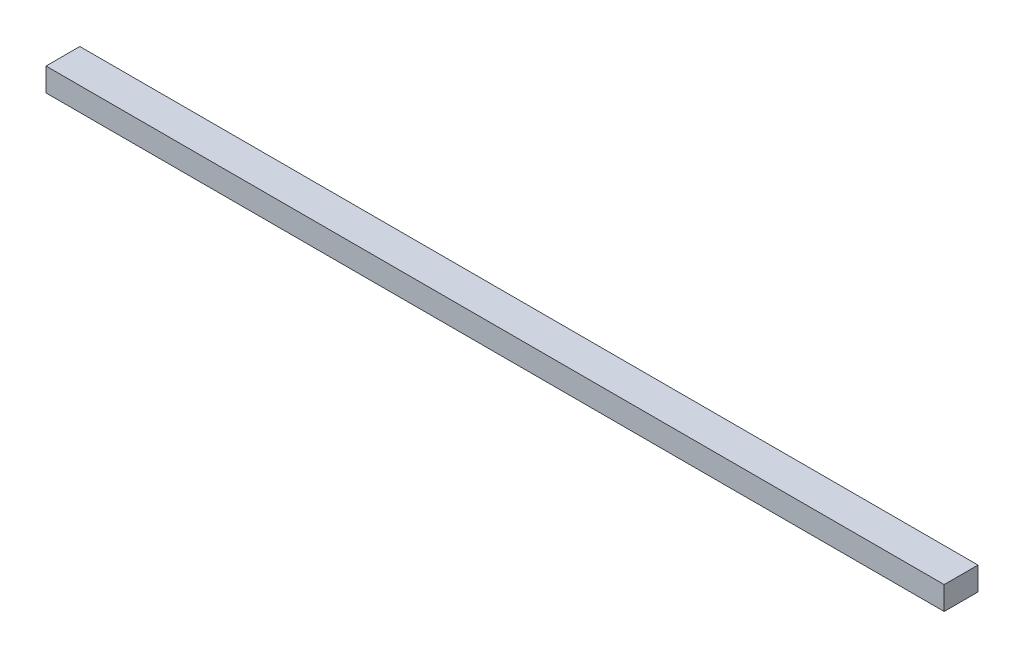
ISO-10303-21;
HEADER;
FILE_DESCRIPTION(('STEP AP214'),'2;1');
FILE_NAME('part.step','',(''),(''),'','','');
FILE_SCHEMA(('AUTOMOTIVE_DESIGN { 1 0 10303 214 1 1 1 1 }'));
ENDSEC;
DATA;
#1=APPLICATION_CONTEXT('core data for automotive mechanical design processes');
#2=APPLICATION_PROTOCOL_DEFINITION('international standard','automotive_design',2000,#1);
#3=PRODUCT_CONTEXT('',#1,'mechanical');
#4=PRODUCT('Part','Part','',(#3));
#5=PRODUCT_RELATED_PRODUCT_CATEGORY('part','',(#4));
#6=PRODUCT_DEFINITION_FORMATION('','',#4);
#7=PRODUCT_DEFINITION_CONTEXT('part definition',#1,'design');
#8=PRODUCT_DEFINITION('design','',#6,#7);
#9=PRODUCT_DEFINITION_SHAPE('','',#8);
#10=(LENGTH_UNIT() NAMED_UNIT(*) SI_UNIT(.MILLI.,.METRE.));
#11=(NAMED_UNIT(*) PLANE_ANGLE_UNIT() SI_UNIT($,.RADIAN.));
#12=(NAMED_UNIT(*) SI_UNIT($,.STERADIAN.) SOLID_ANGLE_UNIT());
#13=UNCERTAINTY_MEASURE_WITH_UNIT(LENGTH_MEASURE(1.E-05),#10,'distance_accuracy_value','');
#14=(GEOMETRIC_REPRESENTATION_CONTEXT(3) GLOBAL_UNCERTAINTY_ASSIGNED_CONTEXT((#13)) GLOBAL_UNIT_ASSIGNED_CONTEXT((#10,
#11,#12)) REPRESENTATION_CONTEXT('',''));
#15=CARTESIAN_POINT('',(0.,0.,0.));
#16=DIRECTION('',(0.,0.,1.));
#17=DIRECTION('',(1.,0.,0.));
#18=AXIS2_PLACEMENT_3D('',#15,#16,#17);
#19=CARTESIAN_POINT('',(244.475,12.7,9.2075));
#20=DIRECTION('',(-1.,0.,0.));
#21=DIRECTION('',(0.,0.,1.));
#22=AXIS2_PLACEMENT_3D('',#19,#20,#21);
#23=PLANE('',#22);
#24=DIRECTION('',(0.,0.,-1.));
#25=VECTOR('',#24,1.);
#26=CARTESIAN_POINT('',(244.475,0.,9.2075));
#27=LINE('',#26,#25);
#28=CARTESIAN_POINT('',(244.475,0.,9.2075));
#29=VERTEX_POINT('',#28);
#30=CARTESIAN_POINT('',(244.475,0.,-9.2075));
#31=VERTEX_POINT('',#30);
#32=EDGE_CURVE('E95',#29,#31,#27,.T.);
#33=ORIENTED_EDGE('',*,*,#32,.T.);
#34=DIRECTION('',(0.,-1.,0.));
#35=VECTOR('',#34,1.);
#36=CARTESIAN_POINT('',(244.475,12.7,-9.2075));
#37=LINE('',#36,#35);
#38=CARTESIAN_POINT('',(244.475,12.7,-9.2075));
#39=VERTEX_POINT('',#38);
#40=EDGE_CURVE('E11',#39,#31,#37,.T.);
#41=ORIENTED_EDGE('',*,*,#40,.F.);
#42=DIRECTION('',(0.,0.,-1.));
#43=VECTOR('',#42,1.);
#44=CARTESIAN_POINT('',(244.475,12.7,9.2075));
#45=LINE('',#44,#43);
#46=CARTESIAN_POINT('',(244.475,12.7,9.2075));
#47=VERTEX_POINT('',#46);
#48=EDGE_CURVE('E83',#47,#39,#45,.T.);
#49=ORIENTED_EDGE('',*,*,#48,.F.);
#50=DIRECTION('',(0.,-1.,0.));
#51=VECTOR('',#50,1.);
#52=CARTESIAN_POINT('',(244.475,12.7,9.2075));
#53=LINE('',#52,#51);
#54=EDGE_CURVE('E91',#47,#29,#53,.T.);
#55=ORIENTED_EDGE('',*,*,#54,.T.);
#56=EDGE_LOOP('',(#33,#41,#49,#55));
#57=FACE_BOUND('',#56,.T.);
#58=ADVANCED_FACE('F32',(#57),#23,.F.);
#59=CARTESIAN_POINT('',(-244.475,12.7,-9.2075));
#60=DIRECTION('',(0.,0.,1.));
#61=DIRECTION('',(1.,0.,0.));
#62=AXIS2_PLACEMENT_3D('',#59,#60,#61);
#63=PLANE('',#62);
#64=DIRECTION('',(-1.,0.,0.));
#65=VECTOR('',#64,1.);
#66=CARTESIAN_POINT('',(-244.475,0.,-9.2075));
#67=LINE('',#66,#65);
#68=CARTESIAN_POINT('',(-244.475,0.,-9.2075));
#69=VERTEX_POINT('',#68);
#70=EDGE_CURVE('E87',#31,#69,#67,.T.);
#71=ORIENTED_EDGE('',*,*,#70,.T.);
#72=DIRECTION('',(0.,-1.,0.));
#73=VECTOR('',#72,1.);
#74=CARTESIAN_POINT('',(-244.475,12.7,-9.2075));
#75=LINE('',#74,#73);
#76=CARTESIAN_POINT('',(-244.475,12.7,-9.2075));
#77=VERTEX_POINT('',#76);
#78=EDGE_CURVE('E40',#77,#69,#75,.T.);
#79=ORIENTED_EDGE('',*,*,#78,.F.);
#80=DIRECTION('',(-1.,0.,0.));
#81=VECTOR('',#80,1.);
#82=CARTESIAN_POINT('',(-244.475,12.7,-9.2075));
#83=LINE('',#82,#81);
#84=EDGE_CURVE('E78',#39,#77,#83,.T.);
#85=ORIENTED_EDGE('',*,*,#84,.F.);
#86=ORIENTED_EDGE('',*,*,#40,.T.);
#87=EDGE_LOOP('',(#71,#79,#85,#86));
#88=FACE_BOUND('',#87,.T.);
#89=ADVANCED_FACE('F86',(#88),#63,.F.);
#90=CARTESIAN_POINT('',(-244.475,12.7,9.2075));
#91=DIRECTION('',(1.,0.,0.));
#92=DIRECTION('',(0.,0.,-1.));
#93=AXIS2_PLACEMENT_3D('',#90,#91,#92);
#94=PLANE('',#93);
#95=DIRECTION('',(0.,0.,1.));
#96=VECTOR('',#95,1.);
#97=CARTESIAN_POINT('',(-244.475,0.,9.2075));
#98=LINE('',#97,#96);
#99=CARTESIAN_POINT('',(-244.475,0.,9.2075));
#100=VERTEX_POINT('',#99);
#101=EDGE_CURVE('E65',#69,#100,#98,.T.);
#102=ORIENTED_EDGE('',*,*,#101,.T.);
#103=DIRECTION('',(0.,-1.,0.));
#104=VECTOR('',#103,1.);
#105=CARTESIAN_POINT('',(-244.475,12.7,9.2075));
#106=LINE('',#105,#104);
#107=CARTESIAN_POINT('',(-244.475,12.7,9.2075));
#108=VERTEX_POINT('',#107);
#109=EDGE_CURVE('E88',#108,#100,#106,.T.);
#110=ORIENTED_EDGE('',*,*,#109,.F.);
#111=DIRECTION('',(0.,0.,1.));
#112=VECTOR('',#111,1.);
#113=CARTESIAN_POINT('',(-244.475,12.7,9.2075));
#114=LINE('',#113,#112);
#115=EDGE_CURVE('E81',#77,#108,#114,.T.);
#116=ORIENTED_EDGE('',*,*,#115,.F.);
#117=ORIENTED_EDGE('',*,*,#78,.T.);
#118=EDGE_LOOP('',(#102,#110,#116,#117));
#119=FACE_BOUND('',#118,.T.);
#120=ADVANCED_FACE('F89',(#119),#94,.F.);
#121=CARTESIAN_POINT('',(-244.475,12.7,9.2075));
#122=DIRECTION('',(0.,0.,-1.));
#123=DIRECTION('',(-1.,0.,0.));
#124=AXIS2_PLACEMENT_3D('',#121,#122,#123);
#125=PLANE('',#124);
#126=DIRECTION('',(1.,0.,0.));
#127=VECTOR('',#126,1.);
#128=CARTESIAN_POINT('',(-244.475,0.,9.2075));
#129=LINE('',#128,#127);
#130=EDGE_CURVE('E71',#100,#29,#129,.T.);
#131=ORIENTED_EDGE('',*,*,#130,.T.);
#132=ORIENTED_EDGE('',*,*,#54,.F.);
#133=DIRECTION('',(1.,0.,0.));
#134=VECTOR('',#133,1.);
#135=CARTESIAN_POINT('',(-244.475,12.7,9.2075));
#136=LINE('',#135,#134);
#137=EDGE_CURVE('E48',#108,#47,#136,.T.);
#138=ORIENTED_EDGE('',*,*,#137,.F.);
#139=ORIENTED_EDGE('',*,*,#109,.T.);
#140=EDGE_LOOP('',(#131,#132,#138,#139));
#141=FACE_BOUND('',#140,.T.);
#142=ADVANCED_FACE('F102',(#141),#125,.F.);
#143=CARTESIAN_POINT('',(0.,12.7,0.));
#144=DIRECTION('',(0.,-1.,0.));
#145=DIRECTION('',(0.,0.,-1.));
#146=AXIS2_PLACEMENT_3D('',#143,#144,#145);
#147=PLANE('',#146);
#148=ORIENTED_EDGE('',*,*,#48,.T.);
#149=ORIENTED_EDGE('',*,*,#84,.T.);
#150=ORIENTED_EDGE('',*,*,#115,.T.);
#151=ORIENTED_EDGE('',*,*,#137,.T.);
#152=EDGE_LOOP('',(#148,#149,#150,#151));
#153=FACE_BOUND('',#152,.T.);
#154=ADVANCED_FACE('F79',(#153),#147,.F.);
#155=CARTESIAN_POINT('',(0.,0.,0.));
#156=DIRECTION('',(0.,-1.,0.));
#157=DIRECTION('',(0.,0.,-1.));
#158=AXIS2_PLACEMENT_3D('',#155,#156,#157);
#159=PLANE('',#158);
#160=ORIENTED_EDGE('',*,*,#32,.F.);
#161=ORIENTED_EDGE('',*,*,#130,.F.);
#162=ORIENTED_EDGE('',*,*,#101,.F.);
#163=ORIENTED_EDGE('',*,*,#70,.F.);
#164=EDGE_LOOP('',(#160,#161,#162,#163));
#165=FACE_BOUND('',#164,.T.);
#166=ADVANCED_FACE('F105',(#165),#159,.T.);
#167=CLOSED_SHELL('',(#58,#89,#120,#142,#154,#166));
#168=MANIFOLD_SOLID_BREP('B2',#167);
#169=ADVANCED_BREP_SHAPE_REPRESENTATION('',(#18,#168),#14);
#170=SHAPE_DEFINITION_REPRESENTATION(#9,#169);
ENDSEC;
END-ISO-10303-21;
